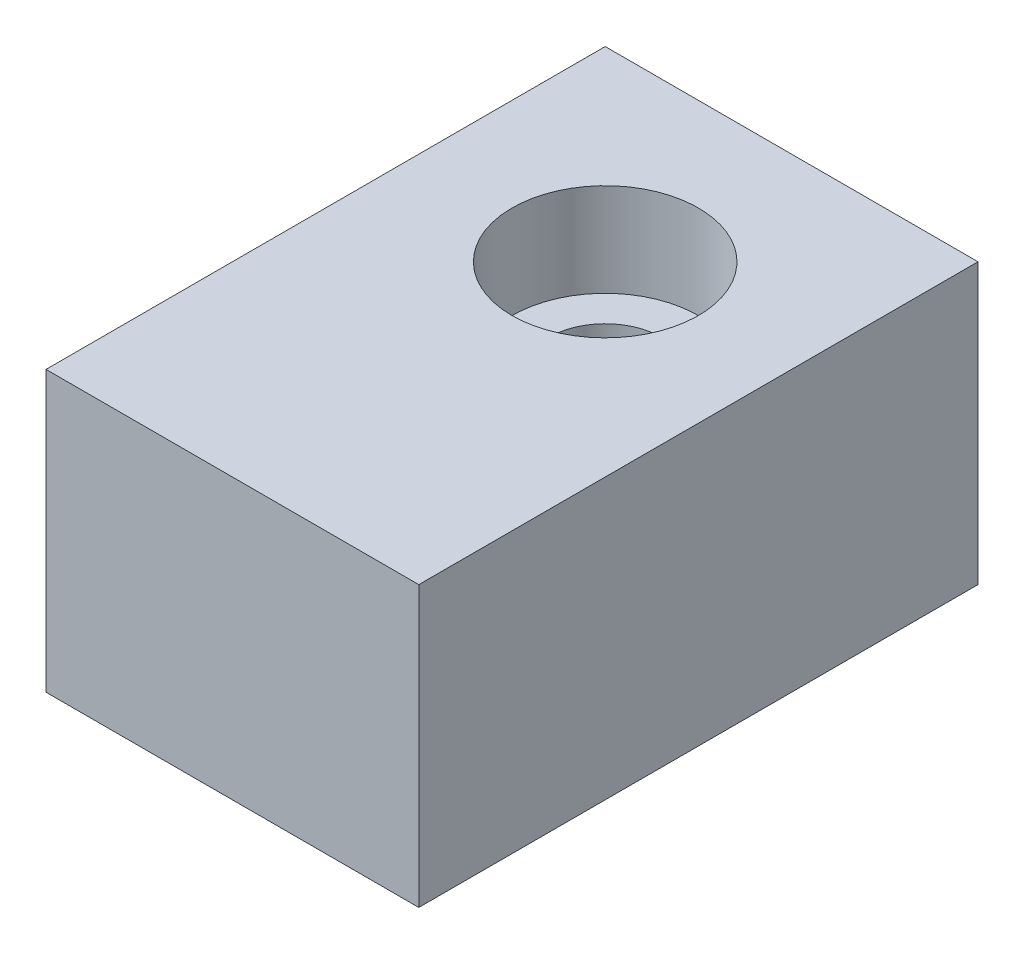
ISO-10303-21;
HEADER;
FILE_DESCRIPTION(('STEP AP214'),'2;1');
FILE_NAME('part.step','',(''),(''),'','','');
FILE_SCHEMA(('AUTOMOTIVE_DESIGN { 1 0 10303 214 1 1 1 1 }'));
ENDSEC;
DATA;
#1=APPLICATION_CONTEXT('core data for automotive mechanical design processes');
#2=APPLICATION_PROTOCOL_DEFINITION('international standard','automotive_design',2000,#1);
#3=PRODUCT_CONTEXT('',#1,'mechanical');
#4=PRODUCT('Part','Part','',(#3));
#5=PRODUCT_RELATED_PRODUCT_CATEGORY('part','',(#4));
#6=PRODUCT_DEFINITION_FORMATION('','',#4);
#7=PRODUCT_DEFINITION_CONTEXT('part definition',#1,'design');
#8=PRODUCT_DEFINITION('design','',#6,#7);
#9=PRODUCT_DEFINITION_SHAPE('','',#8);
#10=(LENGTH_UNIT() NAMED_UNIT(*) SI_UNIT(.MILLI.,.METRE.));
#11=(NAMED_UNIT(*) PLANE_ANGLE_UNIT() SI_UNIT($,.RADIAN.));
#12=(NAMED_UNIT(*) SI_UNIT($,.STERADIAN.) SOLID_ANGLE_UNIT());
#13=UNCERTAINTY_MEASURE_WITH_UNIT(LENGTH_MEASURE(1.E-05),#10,'distance_accuracy_value','');
#14=(GEOMETRIC_REPRESENTATION_CONTEXT(3) GLOBAL_UNCERTAINTY_ASSIGNED_CONTEXT((#13)) GLOBAL_UNIT_ASSIGNED_CONTEXT((#10,
#11,#12)) REPRESENTATION_CONTEXT('',''));
#15=CARTESIAN_POINT('',(0.,0.,0.));
#16=DIRECTION('',(0.,0.,1.));
#17=DIRECTION('',(1.,0.,0.));
#18=AXIS2_PLACEMENT_3D('',#15,#16,#17);
#19=CARTESIAN_POINT('',(20.,-7.5,-15.));
#20=DIRECTION('',(0.,0.,1.));
#21=DIRECTION('',(1.,0.,0.));
#22=AXIS2_PLACEMENT_3D('',#19,#20,#21);
#23=PLANE('',#22);
#24=DIRECTION('',(0.,1.,0.));
#25=VECTOR('',#24,1.);
#26=CARTESIAN_POINT('',(0.,-7.5,-15.));
#27=LINE('',#26,#25);
#28=CARTESIAN_POINT('',(0.,-7.5,-15.));
#29=VERTEX_POINT('',#28);
#30=CARTESIAN_POINT('',(0.,7.5,-15.));
#31=VERTEX_POINT('',#30);
#32=EDGE_CURVE('E96',#29,#31,#27,.T.);
#33=ORIENTED_EDGE('',*,*,#32,.T.);
#34=DIRECTION('',(-1.,0.,0.));
#35=VECTOR('',#34,1.);
#36=CARTESIAN_POINT('',(20.,7.5,-15.));
#37=LINE('',#36,#35);
#38=CARTESIAN_POINT('',(20.,7.5,-15.));
#39=VERTEX_POINT('',#38);
#40=EDGE_CURVE('E11',#39,#31,#37,.T.);
#41=ORIENTED_EDGE('',*,*,#40,.F.);
#42=DIRECTION('',(0.,1.,0.));
#43=VECTOR('',#42,1.);
#44=CARTESIAN_POINT('',(20.,-7.5,-15.));
#45=LINE('',#44,#43);
#46=CARTESIAN_POINT('',(20.,-7.5,-15.));
#47=VERTEX_POINT('',#46);
#48=EDGE_CURVE('E84',#47,#39,#45,.T.);
#49=ORIENTED_EDGE('',*,*,#48,.F.);
#50=DIRECTION('',(-1.,0.,0.));
#51=VECTOR('',#50,1.);
#52=CARTESIAN_POINT('',(20.,-7.5,-15.));
#53=LINE('',#52,#51);
#54=EDGE_CURVE('E92',#47,#29,#53,.T.);
#55=ORIENTED_EDGE('',*,*,#54,.T.);
#56=EDGE_LOOP('',(#33,#41,#49,#55));
#57=FACE_BOUND('',#56,.T.);
#58=ADVANCED_FACE('F33',(#57),#23,.F.);
#59=CARTESIAN_POINT('',(20.,7.5,15.));
#60=DIRECTION('',(0.,-1.,0.));
#61=DIRECTION('',(0.,0.,-1.));
#62=AXIS2_PLACEMENT_3D('',#59,#60,#61);
#63=PLANE('',#62);
#64=CARTESIAN_POINT('',(10.,7.5,-5.));
#65=DIRECTION('',(0.,1.,0.));
#66=DIRECTION('',(0.,0.,1.));
#67=AXIS2_PLACEMENT_3D('',#64,#65,#66);
#68=CIRCLE('',#67,5.);
#69=CARTESIAN_POINT('',(10.,7.5,0.));
#70=VERTEX_POINT('',#69);
#71=EDGE_CURVE('E118',#70,#70,#68,.T.);
#72=ORIENTED_EDGE('',*,*,#71,.F.);
#73=EDGE_LOOP('',(#72));
#74=FACE_BOUND('',#73,.T.);
#75=DIRECTION('',(0.,0.,1.));
#76=VECTOR('',#75,1.);
#77=CARTESIAN_POINT('',(0.,7.5,15.));
#78=LINE('',#77,#76);
#79=CARTESIAN_POINT('',(0.,7.5,15.));
#80=VERTEX_POINT('',#79);
#81=EDGE_CURVE('E88',#31,#80,#78,.T.);
#82=ORIENTED_EDGE('',*,*,#81,.T.);
#83=DIRECTION('',(-1.,0.,0.));
#84=VECTOR('',#83,1.);
#85=CARTESIAN_POINT('',(20.,7.5,15.));
#86=LINE('',#85,#84);
#87=CARTESIAN_POINT('',(20.,7.5,15.));
#88=VERTEX_POINT('',#87);
#89=EDGE_CURVE('E41',#88,#80,#86,.T.);
#90=ORIENTED_EDGE('',*,*,#89,.F.);
#91=DIRECTION('',(0.,0.,1.));
#92=VECTOR('',#91,1.);
#93=CARTESIAN_POINT('',(20.,7.5,15.));
#94=LINE('',#93,#92);
#95=EDGE_CURVE('E79',#39,#88,#94,.T.);
#96=ORIENTED_EDGE('',*,*,#95,.F.);
#97=ORIENTED_EDGE('',*,*,#40,.T.);
#98=EDGE_LOOP('',(#82,#90,#96,#97));
#99=FACE_BOUND('',#98,.T.);
#100=ADVANCED_FACE('F87',(#74,#99),#63,.F.);
#101=CARTESIAN_POINT('',(20.,-7.5,15.));
#102=DIRECTION('',(0.,0.,-1.));
#103=DIRECTION('',(-1.,0.,0.));
#104=AXIS2_PLACEMENT_3D('',#101,#102,#103);
#105=PLANE('',#104);
#106=DIRECTION('',(0.,-1.,0.));
#107=VECTOR('',#106,1.);
#108=CARTESIAN_POINT('',(0.,-7.5,15.));
#109=LINE('',#108,#107);
#110=CARTESIAN_POINT('',(0.,-7.5,15.));
#111=VERTEX_POINT('',#110);
#112=EDGE_CURVE('E66',#80,#111,#109,.T.);
#113=ORIENTED_EDGE('',*,*,#112,.T.);
#114=DIRECTION('',(-1.,0.,0.));
#115=VECTOR('',#114,1.);
#116=CARTESIAN_POINT('',(20.,-7.5,15.));
#117=LINE('',#116,#115);
#118=CARTESIAN_POINT('',(20.,-7.5,15.));
#119=VERTEX_POINT('',#118);
#120=EDGE_CURVE('E89',#119,#111,#117,.T.);
#121=ORIENTED_EDGE('',*,*,#120,.F.);
#122=DIRECTION('',(0.,-1.,0.));
#123=VECTOR('',#122,1.);
#124=CARTESIAN_POINT('',(20.,-7.5,15.));
#125=LINE('',#124,#123);
#126=EDGE_CURVE('E82',#88,#119,#125,.T.);
#127=ORIENTED_EDGE('',*,*,#126,.F.);
#128=ORIENTED_EDGE('',*,*,#89,.T.);
#129=EDGE_LOOP('',(#113,#121,#127,#128));
#130=FACE_BOUND('',#129,.T.);
#131=ADVANCED_FACE('F90',(#130),#105,.F.);
#132=CARTESIAN_POINT('',(20.,-7.5,15.));
#133=DIRECTION('',(0.,1.,0.));
#134=DIRECTION('',(0.,0.,1.));
#135=AXIS2_PLACEMENT_3D('',#132,#133,#134);
#136=PLANE('',#135);
#137=CARTESIAN_POINT('',(10.,-7.5,-5.));
#138=DIRECTION('',(0.,1.,0.));
#139=DIRECTION('',(0.,0.,1.));
#140=AXIS2_PLACEMENT_3D('',#137,#138,#139);
#141=CIRCLE('',#140,3.);
#142=CARTESIAN_POINT('',(10.,-7.5,-2.));
#143=VERTEX_POINT('',#142);
#144=EDGE_CURVE('E99',#143,#143,#141,.T.);
#145=ORIENTED_EDGE('',*,*,#144,.T.);
#146=EDGE_LOOP('',(#145));
#147=FACE_BOUND('',#146,.T.);
#148=DIRECTION('',(0.,0.,-1.));
#149=VECTOR('',#148,1.);
#150=CARTESIAN_POINT('',(0.,-7.5,15.));
#151=LINE('',#150,#149);
#152=EDGE_CURVE('E72',#111,#29,#151,.T.);
#153=ORIENTED_EDGE('',*,*,#152,.T.);
#154=ORIENTED_EDGE('',*,*,#54,.F.);
#155=DIRECTION('',(0.,0.,-1.));
#156=VECTOR('',#155,1.);
#157=CARTESIAN_POINT('',(20.,-7.5,15.));
#158=LINE('',#157,#156);
#159=EDGE_CURVE('E49',#119,#47,#158,.T.);
#160=ORIENTED_EDGE('',*,*,#159,.F.);
#161=ORIENTED_EDGE('',*,*,#120,.T.);
#162=EDGE_LOOP('',(#153,#154,#160,#161));
#163=FACE_BOUND('',#162,.T.);
#164=ADVANCED_FACE('F104',(#147,#163),#136,.F.);
#165=CARTESIAN_POINT('',(20.,7.5,-15.));
#166=DIRECTION('',(-1.,0.,0.));
#167=DIRECTION('',(0.,0.,1.));
#168=AXIS2_PLACEMENT_3D('',#165,#166,#167);
#169=PLANE('',#168);
#170=ORIENTED_EDGE('',*,*,#48,.T.);
#171=ORIENTED_EDGE('',*,*,#95,.T.);
#172=ORIENTED_EDGE('',*,*,#126,.T.);
#173=ORIENTED_EDGE('',*,*,#159,.T.);
#174=EDGE_LOOP('',(#170,#171,#172,#173));
#175=FACE_BOUND('',#174,.T.);
#176=ADVANCED_FACE('F80',(#175),#169,.F.);
#177=CARTESIAN_POINT('',(0.,7.5,-15.));
#178=DIRECTION('',(-1.,0.,0.));
#179=DIRECTION('',(0.,0.,1.));
#180=AXIS2_PLACEMENT_3D('',#177,#178,#179);
#181=PLANE('',#180);
#182=ORIENTED_EDGE('',*,*,#32,.F.);
#183=ORIENTED_EDGE('',*,*,#152,.F.);
#184=ORIENTED_EDGE('',*,*,#112,.F.);
#185=ORIENTED_EDGE('',*,*,#81,.F.);
#186=EDGE_LOOP('',(#182,#183,#184,#185));
#187=FACE_BOUND('',#186,.T.);
#188=ADVANCED_FACE('F107',(#187),#181,.T.);
#189=CARTESIAN_POINT('',(10.,10.1510574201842,-5.));
#190=DIRECTION('',(0.,1.,0.));
#191=DIRECTION('',(0.,0.,1.));
#192=AXIS2_PLACEMENT_3D('',#189,#190,#191);
#193=CYLINDRICAL_SURFACE('',#192,3.);
#194=ORIENTED_EDGE('',*,*,#144,.F.);
#195=EDGE_LOOP('',(#194));
#196=FACE_BOUND('',#195,.T.);
#197=CARTESIAN_POINT('',(10.,2.5,-5.));
#198=DIRECTION('',(0.,1.,0.));
#199=DIRECTION('',(0.,0.,1.));
#200=AXIS2_PLACEMENT_3D('',#197,#198,#199);
#201=CIRCLE('',#200,3.);
#202=CARTESIAN_POINT('',(10.,2.5,-2.));
#203=VERTEX_POINT('',#202);
#204=EDGE_CURVE('E112',#203,#203,#201,.T.);
#205=ORIENTED_EDGE('',*,*,#204,.T.);
#206=EDGE_LOOP('',(#205));
#207=FACE_BOUND('',#206,.T.);
#208=ADVANCED_FACE('F136',(#196,#207),#193,.F.);
#209=CARTESIAN_POINT('',(10.,2.5,0.));
#210=DIRECTION('',(0.,-1.,0.));
#211=DIRECTION('',(0.,0.,-1.));
#212=AXIS2_PLACEMENT_3D('',#209,#210,#211);
#213=PLANE('',#212);
#214=ORIENTED_EDGE('',*,*,#204,.F.);
#215=EDGE_LOOP('',(#214));
#216=FACE_BOUND('',#215,.T.);
#217=CARTESIAN_POINT('',(10.,2.5,-5.));
#218=DIRECTION('',(0.,1.,0.));
#219=DIRECTION('',(0.,0.,1.));
#220=AXIS2_PLACEMENT_3D('',#217,#218,#219);
#221=CIRCLE('',#220,5.);
#222=CARTESIAN_POINT('',(10.,2.5,0.));
#223=VERTEX_POINT('',#222);
#224=EDGE_CURVE('E115',#223,#223,#221,.T.);
#225=ORIENTED_EDGE('',*,*,#224,.T.);
#226=EDGE_LOOP('',(#225));
#227=FACE_BOUND('',#226,.T.);
#228=ADVANCED_FACE('F141',(#216,#227),#213,.F.);
#229=CARTESIAN_POINT('',(10.,10.1510574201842,-5.));
#230=DIRECTION('',(0.,1.,0.));
#231=DIRECTION('',(0.,0.,1.));
#232=AXIS2_PLACEMENT_3D('',#229,#230,#231);
#233=CYLINDRICAL_SURFACE('',#232,5.);
#234=ORIENTED_EDGE('',*,*,#224,.F.);
#235=EDGE_LOOP('',(#234));
#236=FACE_BOUND('',#235,.T.);
#237=ORIENTED_EDGE('',*,*,#71,.T.);
#238=EDGE_LOOP('',(#237));
#239=FACE_BOUND('',#238,.T.);
#240=ADVANCED_FACE('F122',(#236,#239),#233,.F.);
#241=CLOSED_SHELL('',(#58,#100,#131,#164,#176,#188,#208,#228,#240));
#242=MANIFOLD_SOLID_BREP('B2',#241);
#243=ADVANCED_BREP_SHAPE_REPRESENTATION('',(#18,#242),#14);
#244=SHAPE_DEFINITION_REPRESENTATION(#9,#243);
ENDSEC;
END-ISO-10303-21;
